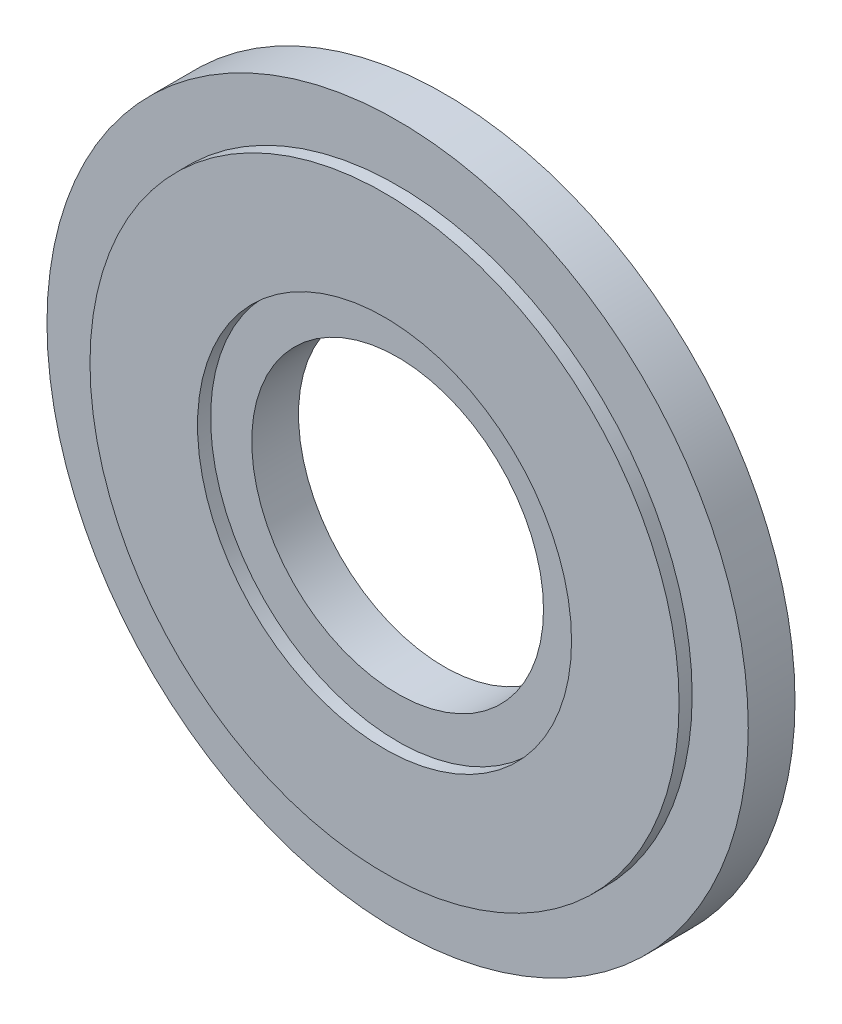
ISO-10303-21;
HEADER;
FILE_DESCRIPTION(('STEP AP214'),'2;1');
FILE_NAME('part.step','',(''),(''),'','','');
FILE_SCHEMA(('AUTOMOTIVE_DESIGN { 1 0 10303 214 1 1 1 1 }'));
ENDSEC;
DATA;
#1=APPLICATION_CONTEXT('core data for automotive mechanical design processes');
#2=APPLICATION_PROTOCOL_DEFINITION('international standard','automotive_design',2000,#1);
#3=PRODUCT_CONTEXT('',#1,'mechanical');
#4=PRODUCT('Part','Part','',(#3));
#5=PRODUCT_RELATED_PRODUCT_CATEGORY('part','',(#4));
#6=PRODUCT_DEFINITION_FORMATION('','',#4);
#7=PRODUCT_DEFINITION_CONTEXT('part definition',#1,'design');
#8=PRODUCT_DEFINITION('design','',#6,#7);
#9=PRODUCT_DEFINITION_SHAPE('','',#8);
#10=(LENGTH_UNIT() NAMED_UNIT(*) SI_UNIT(.MILLI.,.METRE.));
#11=(NAMED_UNIT(*) PLANE_ANGLE_UNIT() SI_UNIT($,.RADIAN.));
#12=(NAMED_UNIT(*) SI_UNIT($,.STERADIAN.) SOLID_ANGLE_UNIT());
#13=UNCERTAINTY_MEASURE_WITH_UNIT(LENGTH_MEASURE(1.E-05),#10,'distance_accuracy_value','');
#14=(GEOMETRIC_REPRESENTATION_CONTEXT(3) GLOBAL_UNCERTAINTY_ASSIGNED_CONTEXT((#13)) GLOBAL_UNIT_ASSIGNED_CONTEXT((#10,
#11,#12)) REPRESENTATION_CONTEXT('',''));
#15=CARTESIAN_POINT('',(0.,0.,0.));
#16=DIRECTION('',(0.,0.,1.));
#17=DIRECTION('',(1.,0.,0.));
#18=AXIS2_PLACEMENT_3D('',#15,#16,#17);
#19=CARTESIAN_POINT('',(0.,0.,-1.26999999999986));
#20=DIRECTION('',(0.,0.,1.));
#21=DIRECTION('',(1.,0.,0.));
#22=AXIS2_PLACEMENT_3D('',#19,#20,#21);
#23=PLANE('',#22);
#24=CARTESIAN_POINT('',(0.,0.,-1.26999999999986));
#25=DIRECTION('',(0.,0.,1.));
#26=DIRECTION('',(1.,0.,0.));
#27=AXIS2_PLACEMENT_3D('',#24,#25,#26);
#28=CIRCLE('',#27,9.525);
#29=CARTESIAN_POINT('',(9.525,0.,-1.26999999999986));
#30=VERTEX_POINT('',#29);
#31=EDGE_CURVE('E41',#30,#30,#28,.T.);
#32=ORIENTED_EDGE('',*,*,#31,.F.);
#33=EDGE_LOOP('',(#32));
#34=FACE_BOUND('',#33,.T.);
#35=CARTESIAN_POINT('',(0.,0.,-1.26999999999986));
#36=DIRECTION('',(0.,0.,1.));
#37=DIRECTION('',(1.,0.,0.));
#38=AXIS2_PLACEMENT_3D('',#35,#36,#37);
#39=CIRCLE('',#38,8.001);
#40=CARTESIAN_POINT('',(8.001,0.,-1.26999999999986));
#41=VERTEX_POINT('',#40);
#42=EDGE_CURVE('E10',#41,#41,#39,.F.);
#43=ORIENTED_EDGE('',*,*,#42,.F.);
#44=EDGE_LOOP('',(#43));
#45=FACE_BOUND('',#44,.T.);
#46=ADVANCED_FACE('F28',(#34,#45),#23,.F.);
#47=CARTESIAN_POINT('',(0.,0.,1.66533453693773E-13));
#48=DIRECTION('',(0.,0.,1.));
#49=DIRECTION('',(1.,0.,0.));
#50=AXIS2_PLACEMENT_3D('',#47,#48,#49);
#51=PLANE('',#50);
#52=CARTESIAN_POINT('',(0.,0.,1.66533453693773E-13));
#53=DIRECTION('',(0.,0.,1.));
#54=DIRECTION('',(1.,0.,0.));
#55=AXIS2_PLACEMENT_3D('',#52,#53,#54);
#56=CIRCLE('',#55,9.525);
#57=CARTESIAN_POINT('',(9.52499999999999,0.,1.66533453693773E-13));
#58=VERTEX_POINT('',#57);
#59=EDGE_CURVE('E52',#58,#58,#56,.T.);
#60=ORIENTED_EDGE('',*,*,#59,.T.);
#61=EDGE_LOOP('',(#60));
#62=FACE_BOUND('',#61,.T.);
#63=CARTESIAN_POINT('',(0.,0.,1.66533453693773E-13));
#64=DIRECTION('',(0.,0.,1.));
#65=DIRECTION('',(1.,0.,0.));
#66=AXIS2_PLACEMENT_3D('',#63,#64,#65);
#67=CIRCLE('',#66,8.001);
#68=CARTESIAN_POINT('',(8.00099999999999,0.,1.66533453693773E-13));
#69=VERTEX_POINT('',#68);
#70=EDGE_CURVE('E32',#69,#69,#67,.F.);
#71=ORIENTED_EDGE('',*,*,#70,.T.);
#72=EDGE_LOOP('',(#71));
#73=FACE_BOUND('',#72,.T.);
#74=ADVANCED_FACE('F62',(#62,#73),#51,.T.);
#75=CARTESIAN_POINT('',(0.,0.,-1.26999999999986));
#76=DIRECTION('',(0.,0.,1.));
#77=DIRECTION('',(1.,0.,0.));
#78=AXIS2_PLACEMENT_3D('',#75,#76,#77);
#79=CYLINDRICAL_SURFACE('',#78,9.525);
#80=ORIENTED_EDGE('',*,*,#31,.T.);
#81=EDGE_LOOP('',(#80));
#82=FACE_BOUND('',#81,.T.);
#83=ORIENTED_EDGE('',*,*,#59,.F.);
#84=EDGE_LOOP('',(#83));
#85=FACE_BOUND('',#84,.T.);
#86=ADVANCED_FACE('F30',(#82,#85),#79,.T.);
#87=CARTESIAN_POINT('',(0.,0.,0.355599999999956));
#88=DIRECTION('',(0.,0.,-1.));
#89=DIRECTION('',(-1.,0.,0.));
#90=AXIS2_PLACEMENT_3D('',#87,#88,#89);
#91=CYLINDRICAL_SURFACE('',#90,8.001);
#92=ORIENTED_EDGE('',*,*,#70,.F.);
#93=EDGE_LOOP('',(#92));
#94=FACE_BOUND('',#93,.T.);
#95=CARTESIAN_POINT('',(0.,0.,0.355599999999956));
#96=DIRECTION('',(0.,0.,1.));
#97=DIRECTION('',(1.,0.,0.));
#98=AXIS2_PLACEMENT_3D('',#95,#96,#97);
#99=CIRCLE('',#98,8.001);
#100=CARTESIAN_POINT('',(8.00099999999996,0.,0.355599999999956));
#101=VERTEX_POINT('',#100);
#102=EDGE_CURVE('E124',#101,#101,#99,.T.);
#103=ORIENTED_EDGE('',*,*,#102,.F.);
#104=EDGE_LOOP('',(#103));
#105=FACE_BOUND('',#104,.T.);
#106=ADVANCED_FACE('F99',(#94,#105),#91,.T.);
#107=CARTESIAN_POINT('',(0.,0.,0.355599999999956));
#108=DIRECTION('',(0.,0.,1.));
#109=DIRECTION('',(1.,0.,0.));
#110=AXIS2_PLACEMENT_3D('',#107,#108,#109);
#111=PLANE('',#110);
#112=ORIENTED_EDGE('',*,*,#102,.T.);
#113=EDGE_LOOP('',(#112));
#114=FACE_BOUND('',#113,.T.);
#115=CARTESIAN_POINT('',(0.,0.,0.355599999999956));
#116=DIRECTION('',(0.,0.,1.));
#117=DIRECTION('',(1.,0.,0.));
#118=AXIS2_PLACEMENT_3D('',#115,#116,#117);
#119=CIRCLE('',#118,5.08);
#120=CARTESIAN_POINT('',(5.07999999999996,0.,0.355599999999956));
#121=VERTEX_POINT('',#120);
#122=EDGE_CURVE('E121',#121,#121,#119,.T.);
#123=ORIENTED_EDGE('',*,*,#122,.F.);
#124=EDGE_LOOP('',(#123));
#125=FACE_BOUND('',#124,.T.);
#126=ADVANCED_FACE('F80',(#114,#125),#111,.T.);
#127=CARTESIAN_POINT('',(0.,0.,0.355599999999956));
#128=DIRECTION('',(0.,0.,-1.));
#129=DIRECTION('',(-1.,0.,0.));
#130=AXIS2_PLACEMENT_3D('',#127,#128,#129);
#131=CYLINDRICAL_SURFACE('',#130,5.08);
#132=CARTESIAN_POINT('',(0.,0.,1.66533453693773E-13));
#133=DIRECTION('',(0.,0.,1.));
#134=DIRECTION('',(1.,0.,0.));
#135=AXIS2_PLACEMENT_3D('',#132,#133,#134);
#136=CIRCLE('',#135,5.08);
#137=CARTESIAN_POINT('',(5.07999999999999,0.,1.66533453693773E-13));
#138=VERTEX_POINT('',#137);
#139=EDGE_CURVE('E36',#138,#138,#136,.F.);
#140=ORIENTED_EDGE('',*,*,#139,.T.);
#141=EDGE_LOOP('',(#140));
#142=FACE_BOUND('',#141,.T.);
#143=ORIENTED_EDGE('',*,*,#122,.T.);
#144=EDGE_LOOP('',(#143));
#145=FACE_BOUND('',#144,.T.);
#146=ADVANCED_FACE('F72',(#142,#145),#131,.F.);
#147=CARTESIAN_POINT('',(0.,0.,-1.26999999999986));
#148=DIRECTION('',(0.,0.,1.));
#149=DIRECTION('',(1.,0.,0.));
#150=AXIS2_PLACEMENT_3D('',#147,#148,#149);
#151=CIRCLE('',#150,5.08);
#152=CARTESIAN_POINT('',(5.08,0.,-1.26999999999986));
#153=VERTEX_POINT('',#152);
#154=EDGE_CURVE('E44',#153,#153,#151,.F.);
#155=ORIENTED_EDGE('',*,*,#154,.T.);
#156=EDGE_LOOP('',(#155));
#157=FACE_BOUND('',#156,.T.);
#158=CARTESIAN_POINT('',(0.,0.,-1.26999999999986));
#159=DIRECTION('',(0.,0.,1.));
#160=DIRECTION('',(1.,0.,0.));
#161=AXIS2_PLACEMENT_3D('',#158,#159,#160);
#162=CIRCLE('',#161,3.9624);
#163=CARTESIAN_POINT('',(3.9624,0.,-1.26999999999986));
#164=VERTEX_POINT('',#163);
#165=EDGE_CURVE('E49',#164,#164,#162,.T.);
#166=ORIENTED_EDGE('',*,*,#165,.T.);
#167=EDGE_LOOP('',(#166));
#168=FACE_BOUND('',#167,.T.);
#169=ADVANCED_FACE('F63',(#157,#168),#23,.F.);
#170=CARTESIAN_POINT('',(0.,0.,-1.26999999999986));
#171=DIRECTION('',(0.,0.,1.));
#172=DIRECTION('',(1.,0.,0.));
#173=AXIS2_PLACEMENT_3D('',#170,#171,#172);
#174=CYLINDRICAL_SURFACE('',#173,3.9624);
#175=ORIENTED_EDGE('',*,*,#165,.F.);
#176=EDGE_LOOP('',(#175));
#177=FACE_BOUND('',#176,.T.);
#178=CARTESIAN_POINT('',(0.,0.,1.66533453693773E-13));
#179=DIRECTION('',(0.,0.,1.));
#180=DIRECTION('',(1.,0.,0.));
#181=AXIS2_PLACEMENT_3D('',#178,#179,#180);
#182=CIRCLE('',#181,3.9624);
#183=CARTESIAN_POINT('',(3.96239999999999,0.,1.66533453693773E-13));
#184=VERTEX_POINT('',#183);
#185=EDGE_CURVE('E46',#184,#184,#182,.T.);
#186=ORIENTED_EDGE('',*,*,#185,.T.);
#187=EDGE_LOOP('',(#186));
#188=FACE_BOUND('',#187,.T.);
#189=ADVANCED_FACE('F71',(#177,#188),#174,.F.);
#190=ORIENTED_EDGE('',*,*,#139,.F.);
#191=EDGE_LOOP('',(#190));
#192=FACE_BOUND('',#191,.T.);
#193=ORIENTED_EDGE('',*,*,#185,.F.);
#194=EDGE_LOOP('',(#193));
#195=FACE_BOUND('',#194,.T.);
#196=ADVANCED_FACE('F69',(#192,#195),#51,.T.);
#197=CARTESIAN_POINT('',(0.,0.,-1.62559999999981));
#198=DIRECTION('',(0.,0.,1.));
#199=DIRECTION('',(1.,0.,0.));
#200=AXIS2_PLACEMENT_3D('',#197,#198,#199);
#201=CIRCLE('',#200,8.001);
#202=CARTESIAN_POINT('',(8.00099999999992,0.,-1.62559999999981));
#203=VERTEX_POINT('',#202);
#204=EDGE_CURVE('E120',#203,#203,#201,.T.);
#205=ORIENTED_EDGE('',*,*,#204,.T.);
#206=EDGE_LOOP('',(#205));
#207=FACE_BOUND('',#206,.T.);
#208=ORIENTED_EDGE('',*,*,#42,.T.);
#209=EDGE_LOOP('',(#208));
#210=FACE_BOUND('',#209,.T.);
#211=ADVANCED_FACE('F92',(#207,#210),#91,.T.);
#212=CARTESIAN_POINT('',(0.,0.,-1.62559999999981));
#213=DIRECTION('',(0.,0.,1.));
#214=DIRECTION('',(1.,0.,0.));
#215=AXIS2_PLACEMENT_3D('',#212,#213,#214);
#216=CIRCLE('',#215,5.08);
#217=CARTESIAN_POINT('',(5.07999999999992,0.,-1.62559999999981));
#218=VERTEX_POINT('',#217);
#219=EDGE_CURVE('E117',#218,#218,#216,.T.);
#220=ORIENTED_EDGE('',*,*,#219,.F.);
#221=EDGE_LOOP('',(#220));
#222=FACE_BOUND('',#221,.T.);
#223=ORIENTED_EDGE('',*,*,#154,.F.);
#224=EDGE_LOOP('',(#223));
#225=FACE_BOUND('',#224,.T.);
#226=ADVANCED_FACE('F83',(#222,#225),#131,.F.);
#227=CARTESIAN_POINT('',(0.,0.,-1.62559999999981));
#228=DIRECTION('',(0.,0.,1.));
#229=DIRECTION('',(1.,0.,0.));
#230=AXIS2_PLACEMENT_3D('',#227,#228,#229);
#231=PLANE('',#230);
#232=ORIENTED_EDGE('',*,*,#219,.T.);
#233=EDGE_LOOP('',(#232));
#234=FACE_BOUND('',#233,.T.);
#235=ORIENTED_EDGE('',*,*,#204,.F.);
#236=EDGE_LOOP('',(#235));
#237=FACE_BOUND('',#236,.T.);
#238=ADVANCED_FACE('F107',(#234,#237),#231,.F.);
#239=CLOSED_SHELL('',(#46,#74,#86,#106,#126,#146,#169,#189,#196,#211,#226,#238));
#240=MANIFOLD_SOLID_BREP('B2',#239);
#241=ADVANCED_BREP_SHAPE_REPRESENTATION('',(#18,#240),#14);
#242=SHAPE_DEFINITION_REPRESENTATION(#9,#241);
ENDSEC;
END-ISO-10303-21;
